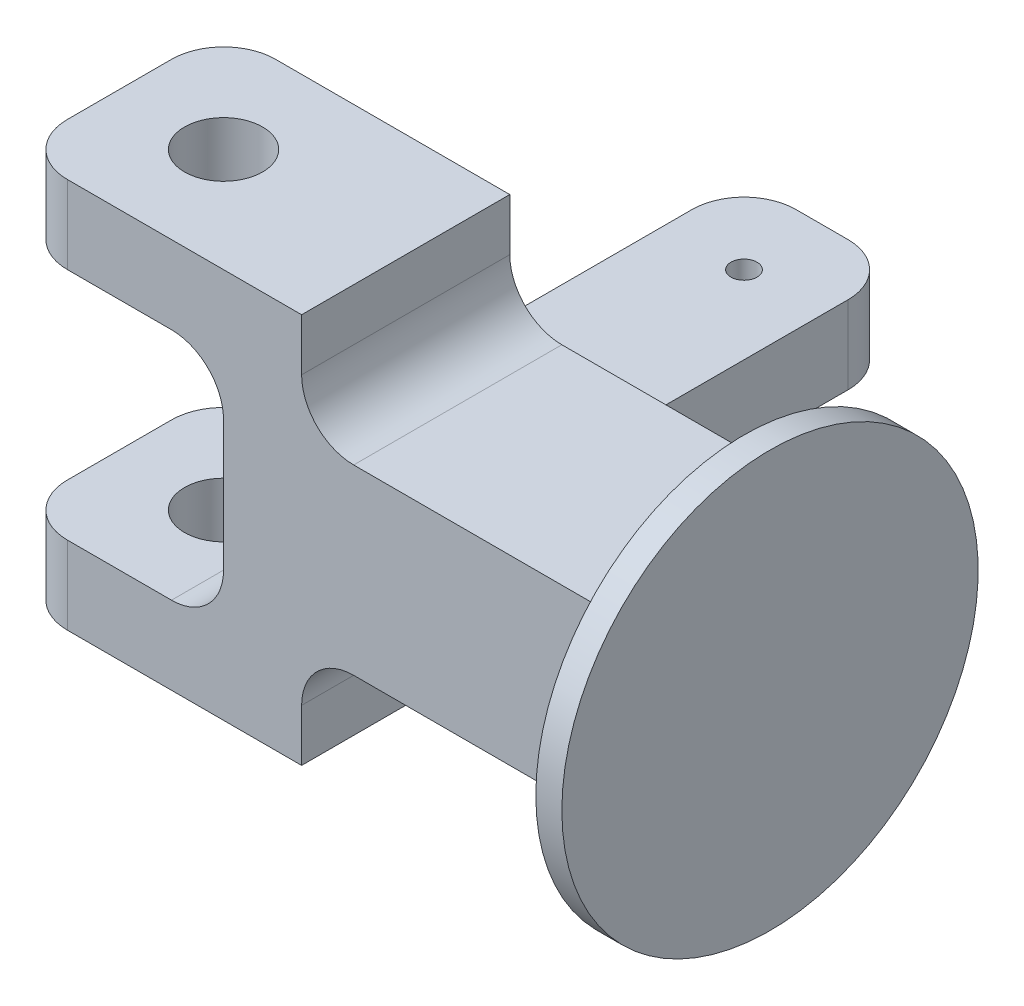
from build123d import *

# Parameters (mm, degrees)
SKETCH1_R           = 3.175
SKETCH1_R_2         = 9.525
BOSS_EXTRUDE1_DEPTH = 47.625
CUT_EXTRUDE1_DEPTH  = 151.436043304
CUT_EXTRUDE2_DEPTH  = 143.875
CUT_EXTRUDE3_DEPTH  = 114.813896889
SKETCH7_R           = 50.8
BOSS_EXTRUDE2_DEPTH = 6.35


with BuildPart() as part:
    # Sketch1 → Boss-Extrude1 (new, symmetric)
    with BuildSketch(Plane(origin=(0, 0, 0), x_dir=(1, 0, 0), z_dir=(0, 1, 0))):
        with BuildLine():
            Line((-63.5, -25.4), (76.2, -25.4))
            Line((76.2, -25.4), (76.2, 25.4))
            Line((76.2, 25.4), (19.05, 25.4))
            Line((19.05, 25.4), (19.05, 82.55))
            ThreePointArc((19.05, 82.55), (15.330256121, 91.530256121), (6.35, 95.25))
            Line((6.35, 95.25), (-6.35, 95.25))
            ThreePointArc((-6.35, 95.25), (-15.330256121, 91.530256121), (-19.05, 82.55))
            Line((-19.05, 82.55), (-19.05, 25.4))
            Line((-19.05, 25.4), (-63.5, 25.4))
            ThreePointArc((-63.5, 25.4), (-72.480256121, 21.680256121), (-76.2, 12.7))
            Line((-76.2, 12.7), (-76.2, -12.7))
            ThreePointArc((-76.2, -12.7), (-72.480256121, -21.680256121), (-63.5, -25.4))
        make_face()
        with Locations(Location((0, 76.2, 0), (0, 0, 270))):
            Circle(SKETCH1_R, mode=Mode.SUBTRACT)
        with Locations(Location((-50.8, 0, 0), (0, 0, 270))):
            Circle(SKETCH1_R_2, mode=Mode.SUBTRACT)
    extrude(amount=BOSS_EXTRUDE1_DEPTH, both=True)

    # Sketch2 → Cut-Extrude1 (cut, through all)
    with BuildSketch(Plane.XY.offset(25.4)):
        with BuildLine():
            Line((-76.2, 28.575), (-38.1, 28.575))
            ThreePointArc((-38.1, 28.575), (-29.119743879, 24.855256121), (-25.4, 15.875))
            Line((-25.4, 15.875), (-25.4, -15.875))
            ThreePointArc((-25.4, -15.875), (-29.119743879, -24.855256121), (-38.1, -28.575))
            Line((-38.1, -28.575), (-76.2, -28.575))
            Line((-76.2, -28.575), (-76.2, 28.575))
        make_face()
    extrude(amount=-CUT_EXTRUDE1_DEPTH, mode=Mode.SUBTRACT)

    # Sketch5 → Cut-Extrude2 (cut, through all)
    with BuildSketch(Plane.ZY.offset(19.05)):
        with BuildLine():
            Line((-95.25, 47.625), (-25.4, 47.625))
            Line((-25.4, 47.625), (-25.4, 22.225))
            ThreePointArc((-25.4, 22.225), (-29.119743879, 13.244743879), (-38.1, 9.525))
            Line((-38.1, 9.525), (-95.25, 9.525))
            Line((-95.25, 9.525), (-95.25, 47.625))
        make_face()
        with BuildLine():
            Line((-38.1, -9.525), (-95.25, -9.525))
            Line((-95.25, -9.525), (-95.25, -47.625))
            Line((-95.25, -47.625), (-25.4, -47.625))
            Line((-25.4, -47.625), (-25.4, -22.225))
            ThreePointArc((-25.4, -22.225), (-29.119743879, -13.244743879), (-38.1, -9.525))
        make_face()
    extrude(amount=-CUT_EXTRUDE2_DEPTH, mode=Mode.SUBTRACT)

    # Sketch6 → Cut-Extrude3 (cut, through all)
    with BuildSketch(Plane(origin=(0, 0, -25.4), x_dir=(-1, 0, 0), z_dir=(0, 0, -1))):
        with BuildLine():
            Line((-76.2, 22.225), (-6.35, 22.225))
            ThreePointArc((-6.35, 22.225), (2.630256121, 25.944743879), (6.35, 34.925))
            Line((6.35, 34.925), (6.35, 47.625))
            Line((6.35, 47.625), (-76.2, 47.625))
            Line((-76.2, 47.625), (-76.2, 22.225))
        make_face()
    cut_extrude3 = extrude(amount=-CUT_EXTRUDE3_DEPTH, mode=Mode.SUBTRACT)

    # Mirror1: Cut-Extrude3 across plane
    add(cut_extrude3.mirror(Plane.ZX), mode=Mode.SUBTRACT)

    # Sketch7 → Boss-Extrude2 (add)
    with BuildSketch(Plane(origin=(76.2, 0, 0), x_dir=(0, 0, -1), z_dir=(1, 0, 0))):
        with Locations(Location((0, 0, 0), (0, 0, 180))):
            Circle(SKETCH7_R)
    extrude(amount=BOSS_EXTRUDE2_DEPTH)


solid = part.part
